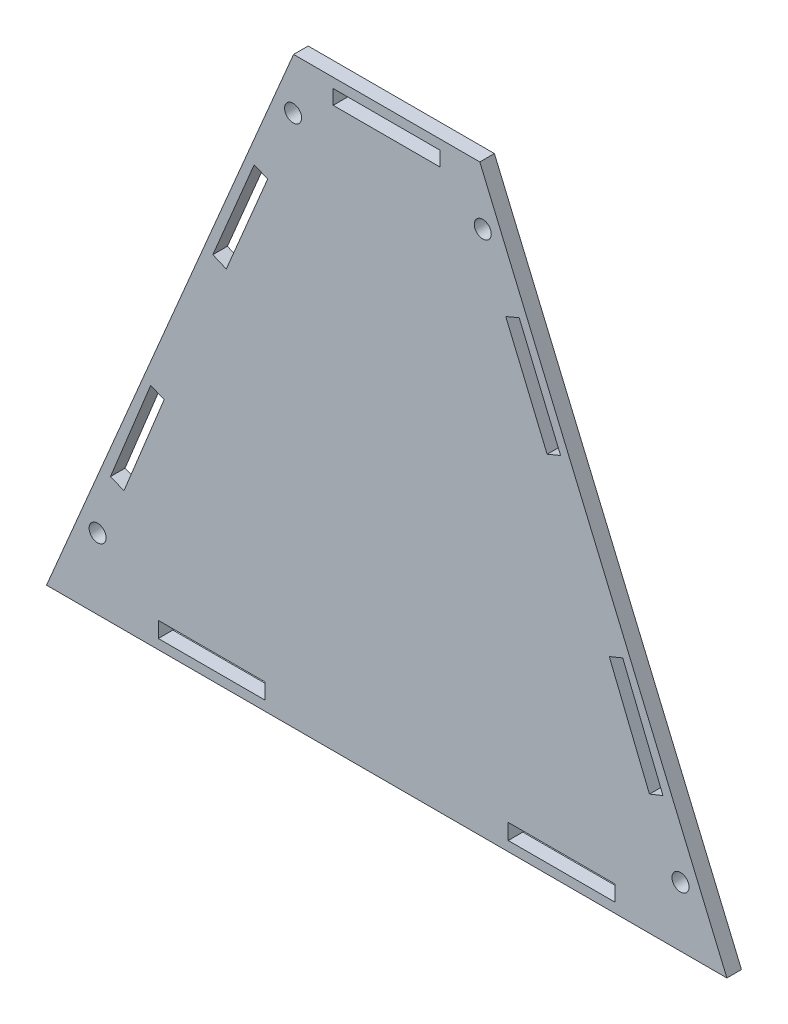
ISO-10303-21;
HEADER;
FILE_DESCRIPTION(('STEP AP214'),'2;1');
FILE_NAME('part.step','',(''),(''),'','','');
FILE_SCHEMA(('AUTOMOTIVE_DESIGN { 1 0 10303 214 1 1 1 1 }'));
ENDSEC;
DATA;
#1=APPLICATION_CONTEXT('core data for automotive mechanical design processes');
#2=APPLICATION_PROTOCOL_DEFINITION('international standard','automotive_design',2000,#1);
#3=PRODUCT_CONTEXT('',#1,'mechanical');
#4=PRODUCT('Part','Part','',(#3));
#5=PRODUCT_RELATED_PRODUCT_CATEGORY('part','',(#4));
#6=PRODUCT_DEFINITION_FORMATION('','',#4);
#7=PRODUCT_DEFINITION_CONTEXT('part definition',#1,'design');
#8=PRODUCT_DEFINITION('design','',#6,#7);
#9=PRODUCT_DEFINITION_SHAPE('','',#8);
#10=(LENGTH_UNIT() NAMED_UNIT(*) SI_UNIT(.MILLI.,.METRE.));
#11=(NAMED_UNIT(*) PLANE_ANGLE_UNIT() SI_UNIT($,.RADIAN.));
#12=(NAMED_UNIT(*) SI_UNIT($,.STERADIAN.) SOLID_ANGLE_UNIT());
#13=UNCERTAINTY_MEASURE_WITH_UNIT(LENGTH_MEASURE(1.E-05),#10,'distance_accuracy_value','');
#14=(GEOMETRIC_REPRESENTATION_CONTEXT(3) GLOBAL_UNCERTAINTY_ASSIGNED_CONTEXT((#13)) GLOBAL_UNIT_ASSIGNED_CONTEXT((#10,
#11,#12)) REPRESENTATION_CONTEXT('',''));
#15=CARTESIAN_POINT('',(0.,0.,0.));
#16=DIRECTION('',(0.,0.,1.));
#17=DIRECTION('',(1.,0.,0.));
#18=AXIS2_PLACEMENT_3D('',#15,#16,#17);
#19=CARTESIAN_POINT('',(0.,0.,3.));
#20=DIRECTION('',(0.,0.,1.));
#21=DIRECTION('',(1.,0.,0.));
#22=AXIS2_PLACEMENT_3D('',#19,#20,#21);
#23=PLANE('',#22);
#24=DIRECTION('',(0.,1.,0.));
#25=VECTOR('',#24,1.);
#26=CARTESIAN_POINT('',(80.9813954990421,0.,3.));
#27=LINE('',#26,#25);
#28=CARTESIAN_POINT('',(80.9813954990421,48.5,3.));
#29=VERTEX_POINT('',#28);
#30=CARTESIAN_POINT('',(80.9813954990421,51.5,3.));
#31=VERTEX_POINT('',#30);
#32=EDGE_CURVE('E418',#29,#31,#27,.T.);
#33=ORIENTED_EDGE('',*,*,#32,.F.);
#34=DIRECTION('',(1.,0.,0.));
#35=VECTOR('',#34,1.);
#36=CARTESIAN_POINT('',(0.,48.5,3.));
#37=LINE('',#36,#35);
#38=CARTESIAN_POINT('',(58.9813954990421,48.5,3.));
#39=VERTEX_POINT('',#38);
#40=EDGE_CURVE('E410',#39,#29,#37,.T.);
#41=ORIENTED_EDGE('',*,*,#40,.F.);
#42=DIRECTION('',(0.,1.,0.));
#43=VECTOR('',#42,1.);
#44=CARTESIAN_POINT('',(58.9813954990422,1.36421881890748E-13,3.));
#45=LINE('',#44,#43);
#46=CARTESIAN_POINT('',(58.9813954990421,51.5,3.));
#47=VERTEX_POINT('',#46);
#48=EDGE_CURVE('E412',#39,#47,#45,.T.);
#49=ORIENTED_EDGE('',*,*,#48,.T.);
#50=DIRECTION('',(1.,0.,0.));
#51=VECTOR('',#50,1.);
#52=CARTESIAN_POINT('',(0.,51.5,3.));
#53=LINE('',#52,#51);
#54=EDGE_CURVE('E415',#47,#31,#53,.T.);
#55=ORIENTED_EDGE('',*,*,#54,.T.);
#56=EDGE_LOOP('',(#33,#41,#49,#55));
#57=FACE_BOUND('',#56,.T.);
#58=DIRECTION('',(-0.9220208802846,0.387140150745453,0.));
#59=VECTOR('',#58,1.);
#60=CARTESIAN_POINT('',(17.0379976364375,40.5780427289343,3.));
#61=LINE('',#60,#59);
#62=CARTESIAN_POINT('',(45.5052483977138,28.6251510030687,3.));
#63=VERTEX_POINT('',#62);
#64=CARTESIAN_POINT('',(42.73918575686,29.7865714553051,3.));
#65=VERTEX_POINT('',#64);
#66=EDGE_CURVE('E408',#63,#65,#61,.T.);
#67=ORIENTED_EDGE('',*,*,#66,.F.);
#68=DIRECTION('',(0.387140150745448,0.922020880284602,0.));
#69=VECTOR('',#68,1.);
#70=CARTESIAN_POINT('',(28.4672507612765,-11.9528917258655,3.));
#71=LINE('',#70,#69);
#72=CARTESIAN_POINT('',(36.9881650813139,8.34069163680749,3.));
#73=VERTEX_POINT('',#72);
#74=EDGE_CURVE('E400',#73,#63,#71,.T.);
#75=ORIENTED_EDGE('',*,*,#74,.F.);
#76=DIRECTION('',(-0.922020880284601,0.387140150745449,0.));
#77=VECTOR('',#76,1.);
#78=CARTESIAN_POINT('',(8.52091432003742,20.293583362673,3.));
#79=LINE('',#78,#77);
#80=CARTESIAN_POINT('',(34.2221024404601,9.50211208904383,3.));
#81=VERTEX_POINT('',#80);
#82=EDGE_CURVE('E402',#73,#81,#79,.T.);
#83=ORIENTED_EDGE('',*,*,#82,.T.);
#84=DIRECTION('',(0.387140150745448,0.922020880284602,0.));
#85=VECTOR('',#84,1.);
#86=CARTESIAN_POINT('',(25.7011881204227,-10.7914712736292,3.));
#87=LINE('',#86,#85);
#88=EDGE_CURVE('E405',#81,#65,#87,.T.);
#89=ORIENTED_EDGE('',*,*,#88,.T.);
#90=EDGE_LOOP('',(#67,#75,#83,#89));
#91=FACE_BOUND('',#90,.T.);
#92=DIRECTION('',(-0.926585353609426,0.376084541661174,0.));
#93=VECTOR('',#92,1.);
#94=CARTESIAN_POINT('',(-4.00304452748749,-9.86257614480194,3.));
#95=LINE('',#94,#93);
#96=CARTESIAN_POINT('',(24.2108349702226,-21.3140888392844,3.));
#97=VERTEX_POINT('',#96);
#98=CARTESIAN_POINT('',(21.4310789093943,-20.1858352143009,3.));
#99=VERTEX_POINT('',#98);
#100=EDGE_CURVE('E398',#97,#99,#95,.T.);
#101=ORIENTED_EDGE('',*,*,#100,.F.);
#102=DIRECTION('',(0.376084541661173,0.926585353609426,0.));
#103=VECTOR('',#102,1.);
#104=CARTESIAN_POINT('',(28.21387949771,-11.4515126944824,3.));
#105=LINE('',#104,#103);
#106=CARTESIAN_POINT('',(15.9369750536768,-41.6989666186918,3.));
#107=VERTEX_POINT('',#106);
#108=EDGE_CURVE('E390',#107,#97,#105,.T.);
#109=ORIENTED_EDGE('',*,*,#108,.F.);
#110=DIRECTION('',(-0.926585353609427,0.376084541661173,0.));
#111=VECTOR('',#110,1.);
#112=CARTESIAN_POINT('',(-12.2769044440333,-30.2474539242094,3.));
#113=LINE('',#112,#111);
#114=CARTESIAN_POINT('',(13.1572189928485,-40.5707129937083,3.));
#115=VERTEX_POINT('',#114);
#116=EDGE_CURVE('E392',#107,#115,#113,.T.);
#117=ORIENTED_EDGE('',*,*,#116,.T.);
#118=DIRECTION('',(0.376084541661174,0.926585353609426,0.));
#119=VECTOR('',#118,1.);
#120=CARTESIAN_POINT('',(25.4341234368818,-10.3232590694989,3.));
#121=LINE('',#120,#119);
#122=EDGE_CURVE('E395',#115,#99,#121,.T.);
#123=ORIENTED_EDGE('',*,*,#122,.T.);
#124=EDGE_LOOP('',(#101,#109,#117,#123));
#125=FACE_BOUND('',#124,.T.);
#126=DIRECTION('',(0.,1.,0.));
#127=VECTOR('',#126,1.);
#128=CARTESIAN_POINT('',(117.,0.,3.));
#129=LINE('',#128,#127);
#130=CARTESIAN_POINT('',(117.,-64.5,3.));
#131=VERTEX_POINT('',#130);
#132=CARTESIAN_POINT('',(117.,-61.2694029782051,3.));
#133=VERTEX_POINT('',#132);
#134=EDGE_CURVE('E377',#131,#133,#129,.T.);
#135=ORIENTED_EDGE('',*,*,#134,.F.);
#136=DIRECTION('',(1.,0.,0.));
#137=VECTOR('',#136,1.);
#138=CARTESIAN_POINT('',(0.,-64.4999999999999,3.));
#139=LINE('',#138,#137);
#140=CARTESIAN_POINT('',(95.,-64.5,3.));
#141=VERTEX_POINT('',#140);
#142=EDGE_CURVE('E269',#141,#131,#139,.T.);
#143=ORIENTED_EDGE('',*,*,#142,.F.);
#144=DIRECTION('',(0.,1.,0.));
#145=VECTOR('',#144,1.);
#146=CARTESIAN_POINT('',(95.,0.,3.));
#147=LINE('',#146,#145);
#148=CARTESIAN_POINT('',(95.,-61.2694029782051,3.));
#149=VERTEX_POINT('',#148);
#150=EDGE_CURVE('E371',#141,#149,#147,.T.);
#151=ORIENTED_EDGE('',*,*,#150,.T.);
#152=DIRECTION('',(1.,0.,0.));
#153=VECTOR('',#152,1.);
#154=CARTESIAN_POINT('',(0.,-61.2694029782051,3.));
#155=LINE('',#154,#153);
#156=EDGE_CURVE('E374',#149,#133,#155,.T.);
#157=ORIENTED_EDGE('',*,*,#156,.T.);
#158=EDGE_LOOP('',(#135,#143,#151,#157));
#159=FACE_BOUND('',#158,.T.);
#160=DIRECTION('',(-1.,0.,0.));
#161=VECTOR('',#160,1.);
#162=CARTESIAN_POINT('',(0.,-61.2694029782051,3.));
#163=LINE('',#162,#161);
#164=CARTESIAN_POINT('',(45.,-61.2694029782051,3.));
#165=VERTEX_POINT('',#164);
#166=CARTESIAN_POINT('',(23.,-61.2694029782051,3.));
#167=VERTEX_POINT('',#166);
#168=EDGE_CURVE('E457',#165,#167,#163,.T.);
#169=ORIENTED_EDGE('',*,*,#168,.F.);
#170=DIRECTION('',(0.,1.,0.));
#171=VECTOR('',#170,1.);
#172=CARTESIAN_POINT('',(45.,0.,3.));
#173=LINE('',#172,#171);
#174=CARTESIAN_POINT('',(45.,-64.5,3.));
#175=VERTEX_POINT('',#174);
#176=EDGE_CURVE('E443',#175,#165,#173,.T.);
#177=ORIENTED_EDGE('',*,*,#176,.F.);
#178=DIRECTION('',(-1.,0.,0.));
#179=VECTOR('',#178,1.);
#180=CARTESIAN_POINT('',(0.,-64.5,3.));
#181=LINE('',#180,#179);
#182=CARTESIAN_POINT('',(23.,-64.5,3.));
#183=VERTEX_POINT('',#182);
#184=EDGE_CURVE('E451',#175,#183,#181,.T.);
#185=ORIENTED_EDGE('',*,*,#184,.T.);
#186=DIRECTION('',(0.,1.,0.));
#187=VECTOR('',#186,1.);
#188=CARTESIAN_POINT('',(23.,0.,3.));
#189=LINE('',#188,#187);
#190=EDGE_CURVE('E454',#183,#167,#189,.T.);
#191=ORIENTED_EDGE('',*,*,#190,.T.);
#192=EDGE_LOOP('',(#169,#177,#185,#191));
#193=FACE_BOUND('',#192,.T.);
#194=CARTESIAN_POINT('',(89.7640486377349,41.8228509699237,3.));
#195=DIRECTION('',(0.,0.,1.));
#196=DIRECTION('',(1.,0.,0.));
#197=AXIS2_PLACEMENT_3D('',#194,#195,#196);
#198=CIRCLE('',#197,1.75);
#199=CARTESIAN_POINT('',(91.5140486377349,41.8228509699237,3.));
#200=VERTEX_POINT('',#199);
#201=EDGE_CURVE('E474',#200,#200,#198,.T.);
#202=ORIENTED_EDGE('',*,*,#201,.F.);
#203=EDGE_LOOP('',(#202));
#204=FACE_BOUND('',#203,.T.);
#205=CARTESIAN_POINT('',(50.7360447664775,43.0032701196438,3.));
#206=DIRECTION('',(0.,0.,1.));
#207=DIRECTION('',(1.,0.,0.));
#208=AXIS2_PLACEMENT_3D('',#205,#206,#207);
#209=CIRCLE('',#208,1.75);
#210=CARTESIAN_POINT('',(52.4860447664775,43.0032701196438,3.));
#211=VERTEX_POINT('',#210);
#212=EDGE_CURVE('E471',#211,#211,#209,.T.);
#213=ORIENTED_EDGE('',*,*,#212,.F.);
#214=EDGE_LOOP('',(#213));
#215=FACE_BOUND('',#214,.T.);
#216=CARTESIAN_POINT('',(10.5103858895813,-51.9452687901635,3.));
#217=DIRECTION('',(0.,0.,1.));
#218=DIRECTION('',(1.,0.,0.));
#219=AXIS2_PLACEMENT_3D('',#216,#217,#218);
#220=CIRCLE('',#219,1.75);
#221=CARTESIAN_POINT('',(12.2603858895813,-51.9452687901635,3.));
#222=VERTEX_POINT('',#221);
#223=EDGE_CURVE('E463',#222,#222,#220,.T.);
#224=ORIENTED_EDGE('',*,*,#223,.F.);
#225=EDGE_LOOP('',(#224));
#226=FACE_BOUND('',#225,.T.);
#227=CARTESIAN_POINT('',(130.451332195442,-54.2153056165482,3.));
#228=DIRECTION('',(0.,0.,1.));
#229=DIRECTION('',(1.,0.,0.));
#230=AXIS2_PLACEMENT_3D('',#227,#228,#229);
#231=CIRCLE('',#230,1.75000000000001);
#232=CARTESIAN_POINT('',(132.201332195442,-54.2153056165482,3.));
#233=VERTEX_POINT('',#232);
#234=EDGE_CURVE('E480',#233,#233,#231,.T.);
#235=ORIENTED_EDGE('',*,*,#234,.F.);
#236=EDGE_LOOP('',(#235));
#237=FACE_BOUND('',#236,.T.);
#238=DIRECTION('',(-0.390093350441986,0.920775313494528,0.));
#239=VECTOR('',#238,1.);
#240=CARTESIAN_POINT('',(89.1611022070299,53.5,3.));
#241=LINE('',#240,#239);
#242=CARTESIAN_POINT('',(140.,-66.5,3.));
#243=VERTEX_POINT('',#242);
#244=CARTESIAN_POINT('',(89.1611022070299,53.5,3.));
#245=VERTEX_POINT('',#244);
#246=EDGE_CURVE('E484',#243,#245,#241,.T.);
#247=ORIENTED_EDGE('',*,*,#246,.T.);
#248=DIRECTION('',(-1.,0.,0.));
#249=VECTOR('',#248,1.);
#250=CARTESIAN_POINT('',(50.8388977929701,53.5,3.));
#251=LINE('',#250,#249);
#252=CARTESIAN_POINT('',(50.8388977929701,53.5,3.));
#253=VERTEX_POINT('',#252);
#254=EDGE_CURVE('E487',#245,#253,#251,.T.);
#255=ORIENTED_EDGE('',*,*,#254,.T.);
#256=DIRECTION('',(-0.390093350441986,-0.920775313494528,0.));
#257=VECTOR('',#256,1.);
#258=CARTESIAN_POINT('',(50.8388977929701,53.5,3.));
#259=LINE('',#258,#257);
#260=CARTESIAN_POINT('',(0.,-66.5,3.));
#261=VERTEX_POINT('',#260);
#262=EDGE_CURVE('E490',#253,#261,#259,.T.);
#263=ORIENTED_EDGE('',*,*,#262,.T.);
#264=DIRECTION('',(1.,0.,0.));
#265=VECTOR('',#264,1.);
#266=CARTESIAN_POINT('',(0.,-66.5,3.));
#267=LINE('',#266,#265);
#268=EDGE_CURVE('E492',#261,#243,#267,.T.);
#269=ORIENTED_EDGE('',*,*,#268,.T.);
#270=EDGE_LOOP('',(#247,#255,#263,#269));
#271=FACE_BOUND('',#270,.T.);
#272=DIRECTION('',(0.926585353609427,0.376084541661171,0.));
#273=VECTOR('',#272,1.);
#274=CARTESIAN_POINT('',(32.0784459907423,-79.0338738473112,3.));
#275=LINE('',#274,#273);
#276=CARTESIAN_POINT('',(124.063024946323,-41.6989666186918,3.));
#277=VERTEX_POINT('',#276);
#278=CARTESIAN_POINT('',(126.842781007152,-40.5707129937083,3.));
#279=VERTEX_POINT('',#278);
#280=EDGE_CURVE('E385',#277,#279,#275,.T.);
#281=ORIENTED_EDGE('',*,*,#280,.F.);
#282=DIRECTION('',(-0.376084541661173,0.926585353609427,0.));
#283=VECTOR('',#282,1.);
#284=CARTESIAN_POINT('',(91.9845789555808,37.3349072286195,3.));
#285=LINE('',#284,#283);
#286=CARTESIAN_POINT('',(115.789165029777,-21.3140888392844,3.));
#287=VERTEX_POINT('',#286);
#288=EDGE_CURVE('E387',#277,#287,#285,.T.);
#289=ORIENTED_EDGE('',*,*,#288,.T.);
#290=DIRECTION('',(0.926585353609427,0.376084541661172,0.));
#291=VECTOR('',#290,1.);
#292=CARTESIAN_POINT('',(23.8045860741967,-58.6489960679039,3.));
#293=LINE('',#292,#291);
#294=CARTESIAN_POINT('',(118.568921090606,-20.1858352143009,3.));
#295=VERTEX_POINT('',#294);
#296=EDGE_CURVE('E379',#287,#295,#293,.T.);
#297=ORIENTED_EDGE('',*,*,#296,.T.);
#298=DIRECTION('',(-0.376084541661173,0.926585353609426,0.));
#299=VECTOR('',#298,1.);
#300=CARTESIAN_POINT('',(94.764335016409,38.463160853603,3.));
#301=LINE('',#300,#299);
#302=EDGE_CURVE('E382',#279,#295,#301,.T.);
#303=ORIENTED_EDGE('',*,*,#302,.F.);
#304=EDGE_LOOP('',(#281,#289,#297,#303));
#305=FACE_BOUND('',#304,.T.);
#306=DIRECTION('',(-0.387140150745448,0.922020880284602,0.));
#307=VECTOR('',#306,1.);
#308=CARTESIAN_POINT('',(90.5498997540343,38.0202906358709,3.));
#309=LINE('',#308,#307);
#310=CARTESIAN_POINT('',(103.011834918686,8.34069163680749,3.));
#311=VERTEX_POINT('',#310);
#312=CARTESIAN_POINT('',(94.4947516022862,28.6251510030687,3.));
#313=VERTEX_POINT('',#312);
#314=EDGE_CURVE('E423',#311,#313,#309,.T.);
#315=ORIENTED_EDGE('',*,*,#314,.T.);
#316=DIRECTION('',(0.922020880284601,0.38714015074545,0.));
#317=VECTOR('',#316,1.);
#318=CARTESIAN_POINT('',(3.94485184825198,-9.39513963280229,3.));
#319=LINE('',#318,#317);
#320=CARTESIAN_POINT('',(97.26081424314,29.7865714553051,3.));
#321=VERTEX_POINT('',#320);
#322=EDGE_CURVE('E426',#313,#321,#319,.T.);
#323=ORIENTED_EDGE('',*,*,#322,.T.);
#324=DIRECTION('',(-0.387140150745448,0.922020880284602,0.));
#325=VECTOR('',#324,1.);
#326=CARTESIAN_POINT('',(93.3159623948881,39.1817110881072,3.));
#327=LINE('',#326,#325);
#328=CARTESIAN_POINT('',(105.77789755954,9.50211208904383,3.));
#329=VERTEX_POINT('',#328);
#330=EDGE_CURVE('E420',#329,#321,#327,.T.);
#331=ORIENTED_EDGE('',*,*,#330,.F.);
#332=DIRECTION('',(0.922020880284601,0.387140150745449,0.));
#333=VECTOR('',#332,1.);
#334=CARTESIAN_POINT('',(12.4619351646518,-29.6795989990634,3.));
#335=LINE('',#334,#333);
#336=EDGE_CURVE('E247',#311,#329,#335,.T.);
#337=ORIENTED_EDGE('',*,*,#336,.F.);
#338=EDGE_LOOP('',(#315,#323,#331,#337));
#339=FACE_BOUND('',#338,.T.);
#340=ADVANCED_FACE('F33',(#57,#91,#125,#159,#193,#204,#215,#226,#237,#271,#305,#339),#23,.T.);
#341=CARTESIAN_POINT('',(0.,0.,0.));
#342=DIRECTION('',(0.,0.,1.));
#343=DIRECTION('',(1.,0.,0.));
#344=AXIS2_PLACEMENT_3D('',#341,#342,#343);
#345=PLANE('',#344);
#346=DIRECTION('',(0.376084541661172,-0.926585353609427,0.));
#347=VECTOR('',#346,1.);
#348=CARTESIAN_POINT('',(115.789165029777,-21.3140888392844,0.));
#349=LINE('',#348,#347);
#350=CARTESIAN_POINT('',(115.789165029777,-21.3140888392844,0.));
#351=VERTEX_POINT('',#350);
#352=CARTESIAN_POINT('',(124.063024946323,-41.6989666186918,0.));
#353=VERTEX_POINT('',#352);
#354=EDGE_CURVE('E320',#351,#353,#349,.T.);
#355=ORIENTED_EDGE('',*,*,#354,.T.);
#356=DIRECTION('',(-0.926585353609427,-0.376084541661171,0.));
#357=VECTOR('',#356,1.);
#358=CARTESIAN_POINT('',(126.842781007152,-40.5707129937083,0.));
#359=LINE('',#358,#357);
#360=CARTESIAN_POINT('',(126.842781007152,-40.5707129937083,0.));
#361=VERTEX_POINT('',#360);
#362=EDGE_CURVE('E346',#361,#353,#359,.T.);
#363=ORIENTED_EDGE('',*,*,#362,.F.);
#364=DIRECTION('',(0.376084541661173,-0.926585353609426,0.));
#365=VECTOR('',#364,1.);
#366=CARTESIAN_POINT('',(118.568921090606,-20.1858352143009,0.));
#367=LINE('',#366,#365);
#368=CARTESIAN_POINT('',(118.568921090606,-20.1858352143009,0.));
#369=VERTEX_POINT('',#368);
#370=EDGE_CURVE('E343',#369,#361,#367,.T.);
#371=ORIENTED_EDGE('',*,*,#370,.F.);
#372=DIRECTION('',(-0.926585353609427,-0.376084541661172,0.));
#373=VECTOR('',#372,1.);
#374=CARTESIAN_POINT('',(118.568921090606,-20.1858352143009,0.));
#375=LINE('',#374,#373);
#376=EDGE_CURVE('E340',#369,#351,#375,.T.);
#377=ORIENTED_EDGE('',*,*,#376,.T.);
#378=EDGE_LOOP('',(#355,#363,#371,#377));
#379=FACE_BOUND('',#378,.T.);
#380=DIRECTION('',(-1.,0.,0.));
#381=VECTOR('',#380,1.);
#382=CARTESIAN_POINT('',(117.,-64.5,0.));
#383=LINE('',#382,#381);
#384=CARTESIAN_POINT('',(117.,-64.5,0.));
#385=VERTEX_POINT('',#384);
#386=CARTESIAN_POINT('',(95.,-64.5,0.));
#387=VERTEX_POINT('',#386);
#388=EDGE_CURVE('E366',#385,#387,#383,.T.);
#389=ORIENTED_EDGE('',*,*,#388,.F.);
#390=DIRECTION('',(0.,-1.,0.));
#391=VECTOR('',#390,1.);
#392=CARTESIAN_POINT('',(117.,-61.2694029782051,0.));
#393=LINE('',#392,#391);
#394=CARTESIAN_POINT('',(117.,-61.2694029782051,0.));
#395=VERTEX_POINT('',#394);
#396=EDGE_CURVE('E333',#395,#385,#393,.T.);
#397=ORIENTED_EDGE('',*,*,#396,.F.);
#398=DIRECTION('',(-1.,0.,0.));
#399=VECTOR('',#398,1.);
#400=CARTESIAN_POINT('',(117.,-61.2694029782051,0.));
#401=LINE('',#400,#399);
#402=CARTESIAN_POINT('',(95.,-61.2694029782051,0.));
#403=VERTEX_POINT('',#402);
#404=EDGE_CURVE('E354',#395,#403,#401,.T.);
#405=ORIENTED_EDGE('',*,*,#404,.T.);
#406=DIRECTION('',(0.,-1.,0.));
#407=VECTOR('',#406,1.);
#408=CARTESIAN_POINT('',(95.,-61.2694029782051,0.));
#409=LINE('',#408,#407);
#410=EDGE_CURVE('E363',#403,#387,#409,.T.);
#411=ORIENTED_EDGE('',*,*,#410,.T.);
#412=EDGE_LOOP('',(#389,#397,#405,#411));
#413=FACE_BOUND('',#412,.T.);
#414=DIRECTION('',(0.,-1.,0.));
#415=VECTOR('',#414,1.);
#416=CARTESIAN_POINT('',(45.,0.,0.));
#417=LINE('',#416,#415);
#418=CARTESIAN_POINT('',(45.,-61.2694029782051,0.));
#419=VERTEX_POINT('',#418);
#420=CARTESIAN_POINT('',(45.,-64.5,0.));
#421=VERTEX_POINT('',#420);
#422=EDGE_CURVE('E431',#419,#421,#417,.T.);
#423=ORIENTED_EDGE('',*,*,#422,.F.);
#424=DIRECTION('',(1.,0.,0.));
#425=VECTOR('',#424,1.);
#426=CARTESIAN_POINT('',(0.,-61.2694029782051,0.));
#427=LINE('',#426,#425);
#428=CARTESIAN_POINT('',(23.,-61.2694029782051,0.));
#429=VERTEX_POINT('',#428);
#430=EDGE_CURVE('E429',#429,#419,#427,.T.);
#431=ORIENTED_EDGE('',*,*,#430,.F.);
#432=DIRECTION('',(0.,-1.,0.));
#433=VECTOR('',#432,1.);
#434=CARTESIAN_POINT('',(23.,0.,0.));
#435=LINE('',#434,#433);
#436=CARTESIAN_POINT('',(23.,-64.5,0.));
#437=VERTEX_POINT('',#436);
#438=EDGE_CURVE('E437',#429,#437,#435,.T.);
#439=ORIENTED_EDGE('',*,*,#438,.T.);
#440=DIRECTION('',(1.,0.,0.));
#441=VECTOR('',#440,1.);
#442=CARTESIAN_POINT('',(0.,-64.5,0.));
#443=LINE('',#442,#441);
#444=EDGE_CURVE('E434',#437,#421,#443,.T.);
#445=ORIENTED_EDGE('',*,*,#444,.T.);
#446=EDGE_LOOP('',(#423,#431,#439,#445));
#447=FACE_BOUND('',#446,.T.);
#448=CARTESIAN_POINT('',(89.7640486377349,41.8228509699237,0.));
#449=DIRECTION('',(0.,0.,-1.));
#450=DIRECTION('',(-1.,0.,0.));
#451=AXIS2_PLACEMENT_3D('',#448,#449,#450);
#452=CIRCLE('',#451,1.75);
#453=CARTESIAN_POINT('',(88.0140486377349,41.8228509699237,0.));
#454=VERTEX_POINT('',#453);
#455=EDGE_CURVE('E460',#454,#454,#452,.T.);
#456=ORIENTED_EDGE('',*,*,#455,.F.);
#457=EDGE_LOOP('',(#456));
#458=FACE_BOUND('',#457,.T.);
#459=CARTESIAN_POINT('',(50.7360447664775,43.0032701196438,0.));
#460=DIRECTION('',(0.,0.,-1.));
#461=DIRECTION('',(-1.,0.,0.));
#462=AXIS2_PLACEMENT_3D('',#459,#460,#461);
#463=CIRCLE('',#462,1.75);
#464=CARTESIAN_POINT('',(48.9860447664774,43.0032701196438,0.));
#465=VERTEX_POINT('',#464);
#466=EDGE_CURVE('E464',#465,#465,#463,.T.);
#467=ORIENTED_EDGE('',*,*,#466,.F.);
#468=EDGE_LOOP('',(#467));
#469=FACE_BOUND('',#468,.T.);
#470=CARTESIAN_POINT('',(10.5103858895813,-51.9452687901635,0.));
#471=DIRECTION('',(0.,0.,-1.));
#472=DIRECTION('',(-1.,0.,0.));
#473=AXIS2_PLACEMENT_3D('',#470,#471,#472);
#474=CIRCLE('',#473,1.75);
#475=CARTESIAN_POINT('',(8.7603858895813,-51.9452687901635,0.));
#476=VERTEX_POINT('',#475);
#477=EDGE_CURVE('E459',#476,#476,#474,.T.);
#478=ORIENTED_EDGE('',*,*,#477,.F.);
#479=EDGE_LOOP('',(#478));
#480=FACE_BOUND('',#479,.T.);
#481=CARTESIAN_POINT('',(130.451332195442,-54.2153056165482,0.));
#482=DIRECTION('',(0.,0.,-1.));
#483=DIRECTION('',(-1.,0.,0.));
#484=AXIS2_PLACEMENT_3D('',#481,#482,#483);
#485=CIRCLE('',#484,1.75000000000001);
#486=CARTESIAN_POINT('',(128.701332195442,-54.2153056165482,0.));
#487=VERTEX_POINT('',#486);
#488=EDGE_CURVE('E477',#487,#487,#485,.T.);
#489=ORIENTED_EDGE('',*,*,#488,.F.);
#490=EDGE_LOOP('',(#489));
#491=FACE_BOUND('',#490,.T.);
#492=DIRECTION('',(-0.390093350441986,0.920775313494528,0.));
#493=VECTOR('',#492,1.);
#494=CARTESIAN_POINT('',(89.1611022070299,53.5,0.));
#495=LINE('',#494,#493);
#496=CARTESIAN_POINT('',(140.,-66.5,0.));
#497=VERTEX_POINT('',#496);
#498=CARTESIAN_POINT('',(89.1611022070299,53.5,0.));
#499=VERTEX_POINT('',#498);
#500=EDGE_CURVE('E483',#497,#499,#495,.T.);
#501=ORIENTED_EDGE('',*,*,#500,.F.);
#502=DIRECTION('',(1.,0.,0.));
#503=VECTOR('',#502,1.);
#504=CARTESIAN_POINT('',(0.,-66.5,0.));
#505=LINE('',#504,#503);
#506=CARTESIAN_POINT('',(0.,-66.5,0.));
#507=VERTEX_POINT('',#506);
#508=EDGE_CURVE('E488',#507,#497,#505,.T.);
#509=ORIENTED_EDGE('',*,*,#508,.F.);
#510=DIRECTION('',(-0.390093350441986,-0.920775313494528,0.));
#511=VECTOR('',#510,1.);
#512=CARTESIAN_POINT('',(50.8388977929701,53.5,0.));
#513=LINE('',#512,#511);
#514=CARTESIAN_POINT('',(50.8388977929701,53.5,0.));
#515=VERTEX_POINT('',#514);
#516=EDGE_CURVE('E499',#515,#507,#513,.T.);
#517=ORIENTED_EDGE('',*,*,#516,.F.);
#518=DIRECTION('',(-1.,0.,0.));
#519=VECTOR('',#518,1.);
#520=CARTESIAN_POINT('',(50.8388977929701,53.5,0.));
#521=LINE('',#520,#519);
#522=EDGE_CURVE('E497',#499,#515,#521,.T.);
#523=ORIENTED_EDGE('',*,*,#522,.F.);
#524=EDGE_LOOP('',(#501,#509,#517,#523));
#525=FACE_BOUND('',#524,.T.);
#526=DIRECTION('',(-0.376084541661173,-0.926585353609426,0.));
#527=VECTOR('',#526,1.);
#528=CARTESIAN_POINT('',(24.2108349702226,-21.3140888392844,0.));
#529=LINE('',#528,#527);
#530=CARTESIAN_POINT('',(24.2108349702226,-21.3140888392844,0.));
#531=VERTEX_POINT('',#530);
#532=CARTESIAN_POINT('',(15.9369750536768,-41.6989666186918,0.));
#533=VERTEX_POINT('',#532);
#534=EDGE_CURVE('E326',#531,#533,#529,.T.);
#535=ORIENTED_EDGE('',*,*,#534,.F.);
#536=DIRECTION('',(0.926585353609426,-0.376084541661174,0.));
#537=VECTOR('',#536,1.);
#538=CARTESIAN_POINT('',(21.4310789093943,-20.1858352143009,0.));
#539=LINE('',#538,#537);
#540=CARTESIAN_POINT('',(21.4310789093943,-20.1858352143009,0.));
#541=VERTEX_POINT('',#540);
#542=EDGE_CURVE('E300',#541,#531,#539,.T.);
#543=ORIENTED_EDGE('',*,*,#542,.F.);
#544=DIRECTION('',(-0.376084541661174,-0.926585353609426,0.));
#545=VECTOR('',#544,1.);
#546=CARTESIAN_POINT('',(21.4310789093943,-20.1858352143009,0.));
#547=LINE('',#546,#545);
#548=CARTESIAN_POINT('',(13.1572189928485,-40.5707129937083,0.));
#549=VERTEX_POINT('',#548);
#550=EDGE_CURVE('E313',#541,#549,#547,.T.);
#551=ORIENTED_EDGE('',*,*,#550,.T.);
#552=DIRECTION('',(0.926585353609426,-0.376084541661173,0.));
#553=VECTOR('',#552,1.);
#554=CARTESIAN_POINT('',(13.1572189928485,-40.5707129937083,0.));
#555=LINE('',#554,#553);
#556=EDGE_CURVE('E323',#549,#533,#555,.T.);
#557=ORIENTED_EDGE('',*,*,#556,.T.);
#558=EDGE_LOOP('',(#535,#543,#551,#557));
#559=FACE_BOUND('',#558,.T.);
#560=DIRECTION('',(-0.387140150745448,-0.922020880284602,0.));
#561=VECTOR('',#560,1.);
#562=CARTESIAN_POINT('',(45.5052483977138,28.6251510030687,0.));
#563=LINE('',#562,#561);
#564=CARTESIAN_POINT('',(45.5052483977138,28.6251510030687,0.));
#565=VERTEX_POINT('',#564);
#566=CARTESIAN_POINT('',(36.9881650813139,8.34069163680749,0.));
#567=VERTEX_POINT('',#566);
#568=EDGE_CURVE('E306',#565,#567,#563,.T.);
#569=ORIENTED_EDGE('',*,*,#568,.F.);
#570=DIRECTION('',(0.9220208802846,-0.387140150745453,0.));
#571=VECTOR('',#570,1.);
#572=CARTESIAN_POINT('',(42.73918575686,29.7865714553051,0.));
#573=LINE('',#572,#571);
#574=CARTESIAN_POINT('',(42.73918575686,29.7865714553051,0.));
#575=VERTEX_POINT('',#574);
#576=EDGE_CURVE('E279',#575,#565,#573,.T.);
#577=ORIENTED_EDGE('',*,*,#576,.F.);
#578=DIRECTION('',(-0.387140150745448,-0.922020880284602,0.));
#579=VECTOR('',#578,1.);
#580=CARTESIAN_POINT('',(42.73918575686,29.7865714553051,0.));
#581=LINE('',#580,#579);
#582=CARTESIAN_POINT('',(34.2221024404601,9.50211208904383,0.));
#583=VERTEX_POINT('',#582);
#584=EDGE_CURVE('E293',#575,#583,#581,.T.);
#585=ORIENTED_EDGE('',*,*,#584,.T.);
#586=DIRECTION('',(0.922020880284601,-0.387140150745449,0.));
#587=VECTOR('',#586,1.);
#588=CARTESIAN_POINT('',(34.2221024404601,9.50211208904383,0.));
#589=LINE('',#588,#587);
#590=EDGE_CURVE('E303',#583,#567,#589,.T.);
#591=ORIENTED_EDGE('',*,*,#590,.T.);
#592=EDGE_LOOP('',(#569,#577,#585,#591));
#593=FACE_BOUND('',#592,.T.);
#594=DIRECTION('',(-1.,0.,0.));
#595=VECTOR('',#594,1.);
#596=CARTESIAN_POINT('',(80.9813954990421,48.5,0.));
#597=LINE('',#596,#595);
#598=CARTESIAN_POINT('',(80.9813954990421,48.5,0.));
#599=VERTEX_POINT('',#598);
#600=CARTESIAN_POINT('',(58.9813954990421,48.5,0.));
#601=VERTEX_POINT('',#600);
#602=EDGE_CURVE('E285',#599,#601,#597,.T.);
#603=ORIENTED_EDGE('',*,*,#602,.F.);
#604=DIRECTION('',(0.,-1.,0.));
#605=VECTOR('',#604,1.);
#606=CARTESIAN_POINT('',(80.9813954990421,51.5,0.));
#607=LINE('',#606,#605);
#608=CARTESIAN_POINT('',(80.9813954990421,51.5,0.));
#609=VERTEX_POINT('',#608);
#610=EDGE_CURVE('E287',#609,#599,#607,.T.);
#611=ORIENTED_EDGE('',*,*,#610,.F.);
#612=DIRECTION('',(-1.,0.,0.));
#613=VECTOR('',#612,1.);
#614=CARTESIAN_POINT('',(80.9813954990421,51.5,0.));
#615=LINE('',#614,#613);
#616=CARTESIAN_POINT('',(58.9813954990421,51.5,0.));
#617=VERTEX_POINT('',#616);
#618=EDGE_CURVE('E273',#609,#617,#615,.T.);
#619=ORIENTED_EDGE('',*,*,#618,.T.);
#620=DIRECTION('',(0.,-1.,0.));
#621=VECTOR('',#620,1.);
#622=CARTESIAN_POINT('',(58.9813954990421,51.5,0.));
#623=LINE('',#622,#621);
#624=EDGE_CURVE('E282',#617,#601,#623,.T.);
#625=ORIENTED_EDGE('',*,*,#624,.T.);
#626=EDGE_LOOP('',(#603,#611,#619,#625));
#627=FACE_BOUND('',#626,.T.);
#628=DIRECTION('',(-0.922020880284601,-0.38714015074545,0.));
#629=VECTOR('',#628,1.);
#630=CARTESIAN_POINT('',(97.26081424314,29.7865714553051,0.));
#631=LINE('',#630,#629);
#632=CARTESIAN_POINT('',(97.26081424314,29.7865714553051,0.));
#633=VERTEX_POINT('',#632);
#634=CARTESIAN_POINT('',(94.4947516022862,28.6251510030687,0.));
#635=VERTEX_POINT('',#634);
#636=EDGE_CURVE('E264',#633,#635,#631,.T.);
#637=ORIENTED_EDGE('',*,*,#636,.T.);
#638=DIRECTION('',(0.387140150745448,-0.922020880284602,0.));
#639=VECTOR('',#638,1.);
#640=CARTESIAN_POINT('',(94.4947516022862,28.6251510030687,0.));
#641=LINE('',#640,#639);
#642=CARTESIAN_POINT('',(103.011834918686,8.34069163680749,0.));
#643=VERTEX_POINT('',#642);
#644=EDGE_CURVE('E262',#635,#643,#641,.T.);
#645=ORIENTED_EDGE('',*,*,#644,.T.);
#646=DIRECTION('',(-0.922020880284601,-0.387140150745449,0.));
#647=VECTOR('',#646,1.);
#648=CARTESIAN_POINT('',(105.77789755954,9.50211208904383,0.));
#649=LINE('',#648,#647);
#650=CARTESIAN_POINT('',(105.77789755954,9.50211208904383,0.));
#651=VERTEX_POINT('',#650);
#652=EDGE_CURVE('E244',#651,#643,#649,.T.);
#653=ORIENTED_EDGE('',*,*,#652,.F.);
#654=DIRECTION('',(0.387140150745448,-0.922020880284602,0.));
#655=VECTOR('',#654,1.);
#656=CARTESIAN_POINT('',(97.26081424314,29.7865714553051,0.));
#657=LINE('',#656,#655);
#658=EDGE_CURVE('E254',#633,#651,#657,.T.);
#659=ORIENTED_EDGE('',*,*,#658,.F.);
#660=EDGE_LOOP('',(#637,#645,#653,#659));
#661=FACE_BOUND('',#660,.T.);
#662=ADVANCED_FACE('F260',(#379,#413,#447,#458,#469,#480,#491,#525,#559,#593,#627,#661),#345,.F.);
#663=CARTESIAN_POINT('',(89.1611022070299,53.5,3.));
#664=DIRECTION('',(-0.920775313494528,-0.390093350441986,0.));
#665=DIRECTION('',(0.390093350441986,-0.920775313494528,0.));
#666=AXIS2_PLACEMENT_3D('',#663,#664,#665);
#667=PLANE('',#666);
#668=ORIENTED_EDGE('',*,*,#500,.T.);
#669=DIRECTION('',(0.,0.,-1.));
#670=VECTOR('',#669,1.);
#671=CARTESIAN_POINT('',(89.1611022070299,53.5,3.));
#672=LINE('',#671,#670);
#673=EDGE_CURVE('E11',#245,#499,#672,.T.);
#674=ORIENTED_EDGE('',*,*,#673,.F.);
#675=ORIENTED_EDGE('',*,*,#246,.F.);
#676=DIRECTION('',(0.,0.,-1.));
#677=VECTOR('',#676,1.);
#678=CARTESIAN_POINT('',(140.,-66.5,3.));
#679=LINE('',#678,#677);
#680=EDGE_CURVE('E494',#243,#497,#679,.T.);
#681=ORIENTED_EDGE('',*,*,#680,.T.);
#682=EDGE_LOOP('',(#668,#674,#675,#681));
#683=FACE_BOUND('',#682,.T.);
#684=ADVANCED_FACE('F35',(#683),#667,.F.);
#685=CARTESIAN_POINT('',(50.8388977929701,53.5,3.));
#686=DIRECTION('',(0.,-1.,0.));
#687=DIRECTION('',(1.,0.,0.));
#688=AXIS2_PLACEMENT_3D('',#685,#686,#687);
#689=PLANE('',#688);
#690=ORIENTED_EDGE('',*,*,#522,.T.);
#691=DIRECTION('',(0.,0.,-1.));
#692=VECTOR('',#691,1.);
#693=CARTESIAN_POINT('',(50.8388977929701,53.5,3.));
#694=LINE('',#693,#692);
#695=EDGE_CURVE('E41',#253,#515,#694,.T.);
#696=ORIENTED_EDGE('',*,*,#695,.F.);
#697=ORIENTED_EDGE('',*,*,#254,.F.);
#698=ORIENTED_EDGE('',*,*,#673,.T.);
#699=EDGE_LOOP('',(#690,#696,#697,#698));
#700=FACE_BOUND('',#699,.T.);
#701=ADVANCED_FACE('F527',(#700),#689,.F.);
#702=CARTESIAN_POINT('',(50.8388977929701,53.5,3.));
#703=DIRECTION('',(0.920775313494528,-0.390093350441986,0.));
#704=DIRECTION('',(0.390093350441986,0.920775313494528,0.));
#705=AXIS2_PLACEMENT_3D('',#702,#703,#704);
#706=PLANE('',#705);
#707=ORIENTED_EDGE('',*,*,#516,.T.);
#708=DIRECTION('',(0.,0.,-1.));
#709=VECTOR('',#708,1.);
#710=CARTESIAN_POINT('',(0.,-66.5,3.));
#711=LINE('',#710,#709);
#712=EDGE_CURVE('E504',#261,#507,#711,.T.);
#713=ORIENTED_EDGE('',*,*,#712,.F.);
#714=ORIENTED_EDGE('',*,*,#262,.F.);
#715=ORIENTED_EDGE('',*,*,#695,.T.);
#716=EDGE_LOOP('',(#707,#713,#714,#715));
#717=FACE_BOUND('',#716,.T.);
#718=ADVANCED_FACE('F511',(#717),#706,.F.);
#719=CARTESIAN_POINT('',(0.,-66.5,3.));
#720=DIRECTION('',(0.,1.,0.));
#721=DIRECTION('',(0.,0.,1.));
#722=AXIS2_PLACEMENT_3D('',#719,#720,#721);
#723=PLANE('',#722);
#724=ORIENTED_EDGE('',*,*,#508,.T.);
#725=ORIENTED_EDGE('',*,*,#680,.F.);
#726=ORIENTED_EDGE('',*,*,#268,.F.);
#727=ORIENTED_EDGE('',*,*,#712,.T.);
#728=EDGE_LOOP('',(#724,#725,#726,#727));
#729=FACE_BOUND('',#728,.T.);
#730=ADVANCED_FACE('F520',(#729),#723,.F.);
#731=CARTESIAN_POINT('',(130.451332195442,-54.2153056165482,6.));
#732=DIRECTION('',(0.,0.,-1.));
#733=DIRECTION('',(-1.,0.,0.));
#734=AXIS2_PLACEMENT_3D('',#731,#732,#733);
#735=CYLINDRICAL_SURFACE('',#734,1.75000000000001);
#736=ORIENTED_EDGE('',*,*,#234,.T.);
#737=EDGE_LOOP('',(#736));
#738=FACE_BOUND('',#737,.T.);
#739=ORIENTED_EDGE('',*,*,#488,.T.);
#740=EDGE_LOOP('',(#739));
#741=FACE_BOUND('',#740,.T.);
#742=ADVANCED_FACE('F545',(#738,#741),#735,.F.);
#743=CARTESIAN_POINT('',(10.5103858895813,-51.9452687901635,6.));
#744=DIRECTION('',(0.,0.,-1.));
#745=DIRECTION('',(-1.,0.,0.));
#746=AXIS2_PLACEMENT_3D('',#743,#744,#745);
#747=CYLINDRICAL_SURFACE('',#746,1.75);
#748=ORIENTED_EDGE('',*,*,#223,.T.);
#749=EDGE_LOOP('',(#748));
#750=FACE_BOUND('',#749,.T.);
#751=ORIENTED_EDGE('',*,*,#477,.T.);
#752=EDGE_LOOP('',(#751));
#753=FACE_BOUND('',#752,.T.);
#754=ADVANCED_FACE('F552',(#750,#753),#747,.F.);
#755=CARTESIAN_POINT('',(50.7360447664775,43.0032701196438,6.));
#756=DIRECTION('',(0.,0.,-1.));
#757=DIRECTION('',(-1.,0.,0.));
#758=AXIS2_PLACEMENT_3D('',#755,#756,#757);
#759=CYLINDRICAL_SURFACE('',#758,1.75);
#760=ORIENTED_EDGE('',*,*,#212,.T.);
#761=EDGE_LOOP('',(#760));
#762=FACE_BOUND('',#761,.T.);
#763=ORIENTED_EDGE('',*,*,#466,.T.);
#764=EDGE_LOOP('',(#763));
#765=FACE_BOUND('',#764,.T.);
#766=ADVANCED_FACE('F557',(#762,#765),#759,.F.);
#767=CARTESIAN_POINT('',(89.7640486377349,41.8228509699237,6.));
#768=DIRECTION('',(0.,0.,-1.));
#769=DIRECTION('',(-1.,0.,0.));
#770=AXIS2_PLACEMENT_3D('',#767,#768,#769);
#771=CYLINDRICAL_SURFACE('',#770,1.75);
#772=ORIENTED_EDGE('',*,*,#201,.T.);
#773=EDGE_LOOP('',(#772));
#774=FACE_BOUND('',#773,.T.);
#775=ORIENTED_EDGE('',*,*,#455,.T.);
#776=EDGE_LOOP('',(#775));
#777=FACE_BOUND('',#776,.T.);
#778=ADVANCED_FACE('F567',(#774,#777),#771,.F.);
#779=CARTESIAN_POINT('',(0.,-61.2694029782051,6.));
#780=DIRECTION('',(0.,1.,0.));
#781=DIRECTION('',(0.,0.,1.));
#782=AXIS2_PLACEMENT_3D('',#779,#780,#781);
#783=PLANE('',#782);
#784=ORIENTED_EDGE('',*,*,#168,.T.);
#785=DIRECTION('',(0.,0.,-1.));
#786=VECTOR('',#785,1.);
#787=CARTESIAN_POINT('',(23.,-61.2694029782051,6.));
#788=LINE('',#787,#786);
#789=EDGE_CURVE('E441',#167,#429,#788,.T.);
#790=ORIENTED_EDGE('',*,*,#789,.T.);
#791=ORIENTED_EDGE('',*,*,#430,.T.);
#792=DIRECTION('',(0.,0.,-1.));
#793=VECTOR('',#792,1.);
#794=CARTESIAN_POINT('',(45.,-61.2694029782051,6.));
#795=LINE('',#794,#793);
#796=EDGE_CURVE('E440',#165,#419,#795,.T.);
#797=ORIENTED_EDGE('',*,*,#796,.F.);
#798=EDGE_LOOP('',(#784,#790,#791,#797));
#799=FACE_BOUND('',#798,.T.);
#800=ADVANCED_FACE('F574',(#799),#783,.F.);
#801=CARTESIAN_POINT('',(23.,0.,6.));
#802=DIRECTION('',(1.,0.,0.));
#803=DIRECTION('',(0.,0.,-1.));
#804=AXIS2_PLACEMENT_3D('',#801,#802,#803);
#805=PLANE('',#804);
#806=DIRECTION('',(0.,0.,-1.));
#807=VECTOR('',#806,1.);
#808=CARTESIAN_POINT('',(23.,-64.5,6.));
#809=LINE('',#808,#807);
#810=EDGE_CURVE('E444',#183,#437,#809,.T.);
#811=ORIENTED_EDGE('',*,*,#810,.T.);
#812=ORIENTED_EDGE('',*,*,#438,.F.);
#813=ORIENTED_EDGE('',*,*,#789,.F.);
#814=ORIENTED_EDGE('',*,*,#190,.F.);
#815=EDGE_LOOP('',(#811,#812,#813,#814));
#816=FACE_BOUND('',#815,.T.);
#817=ADVANCED_FACE('F578',(#816),#805,.T.);
#818=CARTESIAN_POINT('',(0.,-64.5,6.));
#819=DIRECTION('',(0.,1.,0.));
#820=DIRECTION('',(-1.,0.,0.));
#821=AXIS2_PLACEMENT_3D('',#818,#819,#820);
#822=PLANE('',#821);
#823=DIRECTION('',(0.,0.,-1.));
#824=VECTOR('',#823,1.);
#825=CARTESIAN_POINT('',(45.,-64.5,6.));
#826=LINE('',#825,#824);
#827=EDGE_CURVE('E446',#175,#421,#826,.T.);
#828=ORIENTED_EDGE('',*,*,#827,.T.);
#829=ORIENTED_EDGE('',*,*,#444,.F.);
#830=ORIENTED_EDGE('',*,*,#810,.F.);
#831=ORIENTED_EDGE('',*,*,#184,.F.);
#832=EDGE_LOOP('',(#828,#829,#830,#831));
#833=FACE_BOUND('',#832,.T.);
#834=ADVANCED_FACE('F584',(#833),#822,.T.);
#835=CARTESIAN_POINT('',(45.,0.,6.));
#836=DIRECTION('',(1.,0.,0.));
#837=DIRECTION('',(0.,0.,-1.));
#838=AXIS2_PLACEMENT_3D('',#835,#836,#837);
#839=PLANE('',#838);
#840=ORIENTED_EDGE('',*,*,#176,.T.);
#841=ORIENTED_EDGE('',*,*,#796,.T.);
#842=ORIENTED_EDGE('',*,*,#422,.T.);
#843=ORIENTED_EDGE('',*,*,#827,.F.);
#844=EDGE_LOOP('',(#840,#841,#842,#843));
#845=FACE_BOUND('',#844,.T.);
#846=ADVANCED_FACE('F580',(#845),#839,.F.);
#847=CARTESIAN_POINT('',(117.,-61.2694029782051,6.));
#848=DIRECTION('',(1.,0.,0.));
#849=DIRECTION('',(0.,0.,-1.));
#850=AXIS2_PLACEMENT_3D('',#847,#848,#849);
#851=PLANE('',#850);
#852=ORIENTED_EDGE('',*,*,#134,.T.);
#853=DIRECTION('',(0.,0.,-1.));
#854=VECTOR('',#853,1.);
#855=CARTESIAN_POINT('',(117.,-61.2694029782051,6.));
#856=LINE('',#855,#854);
#857=EDGE_CURVE('E359',#133,#395,#856,.T.);
#858=ORIENTED_EDGE('',*,*,#857,.T.);
#859=ORIENTED_EDGE('',*,*,#396,.T.);
#860=DIRECTION('',(0.,0.,-1.));
#861=VECTOR('',#860,1.);
#862=CARTESIAN_POINT('',(117.,-64.5,6.));
#863=LINE('',#862,#861);
#864=EDGE_CURVE('E351',#131,#385,#863,.T.);
#865=ORIENTED_EDGE('',*,*,#864,.F.);
#866=EDGE_LOOP('',(#852,#858,#859,#865));
#867=FACE_BOUND('',#866,.T.);
#868=ADVANCED_FACE('F583',(#867),#851,.F.);
#869=CARTESIAN_POINT('',(117.,-61.2694029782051,6.));
#870=DIRECTION('',(0.,-1.,0.));
#871=DIRECTION('',(0.,0.,-1.));
#872=AXIS2_PLACEMENT_3D('',#869,#870,#871);
#873=PLANE('',#872);
#874=DIRECTION('',(0.,0.,-1.));
#875=VECTOR('',#874,1.);
#876=CARTESIAN_POINT('',(95.,-61.2694029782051,6.));
#877=LINE('',#876,#875);
#878=EDGE_CURVE('E357',#149,#403,#877,.T.);
#879=ORIENTED_EDGE('',*,*,#878,.T.);
#880=ORIENTED_EDGE('',*,*,#404,.F.);
#881=ORIENTED_EDGE('',*,*,#857,.F.);
#882=ORIENTED_EDGE('',*,*,#156,.F.);
#883=EDGE_LOOP('',(#879,#880,#881,#882));
#884=FACE_BOUND('',#883,.T.);
#885=ADVANCED_FACE('F592',(#884),#873,.T.);
#886=CARTESIAN_POINT('',(95.,-61.2694029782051,6.));
#887=DIRECTION('',(1.,0.,0.));
#888=DIRECTION('',(0.,0.,-1.));
#889=AXIS2_PLACEMENT_3D('',#886,#887,#888);
#890=PLANE('',#889);
#891=DIRECTION('',(0.,0.,-1.));
#892=VECTOR('',#891,1.);
#893=CARTESIAN_POINT('',(95.,-64.5,6.));
#894=LINE('',#893,#892);
#895=EDGE_CURVE('E355',#141,#387,#894,.T.);
#896=ORIENTED_EDGE('',*,*,#895,.T.);
#897=ORIENTED_EDGE('',*,*,#410,.F.);
#898=ORIENTED_EDGE('',*,*,#878,.F.);
#899=ORIENTED_EDGE('',*,*,#150,.F.);
#900=EDGE_LOOP('',(#896,#897,#898,#899));
#901=FACE_BOUND('',#900,.T.);
#902=ADVANCED_FACE('F595',(#901),#890,.T.);
#903=CARTESIAN_POINT('',(117.,-64.5,6.));
#904=DIRECTION('',(0.,-1.,0.));
#905=DIRECTION('',(1.,0.,0.));
#906=AXIS2_PLACEMENT_3D('',#903,#904,#905);
#907=PLANE('',#906);
#908=ORIENTED_EDGE('',*,*,#142,.T.);
#909=ORIENTED_EDGE('',*,*,#864,.T.);
#910=ORIENTED_EDGE('',*,*,#388,.T.);
#911=ORIENTED_EDGE('',*,*,#895,.F.);
#912=EDGE_LOOP('',(#908,#909,#910,#911));
#913=FACE_BOUND('',#912,.T.);
#914=ADVANCED_FACE('F599',(#913),#907,.F.);
#915=CARTESIAN_POINT('',(115.789165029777,-21.3140888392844,6.));
#916=DIRECTION('',(0.926585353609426,0.376084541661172,0.));
#917=DIRECTION('',(-0.376084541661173,0.926585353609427,0.));
#918=AXIS2_PLACEMENT_3D('',#915,#916,#917);
#919=PLANE('',#918);
#920=DIRECTION('',(0.,0.,-1.));
#921=VECTOR('',#920,1.);
#922=CARTESIAN_POINT('',(124.063024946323,-41.6989666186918,6.));
#923=LINE('',#922,#921);
#924=EDGE_CURVE('E330',#277,#353,#923,.T.);
#925=ORIENTED_EDGE('',*,*,#924,.T.);
#926=ORIENTED_EDGE('',*,*,#354,.F.);
#927=DIRECTION('',(0.,0.,-1.));
#928=VECTOR('',#927,1.);
#929=CARTESIAN_POINT('',(115.789165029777,-21.3140888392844,6.));
#930=LINE('',#929,#928);
#931=EDGE_CURVE('E337',#287,#351,#930,.T.);
#932=ORIENTED_EDGE('',*,*,#931,.F.);
#933=ORIENTED_EDGE('',*,*,#288,.F.);
#934=EDGE_LOOP('',(#925,#926,#932,#933));
#935=FACE_BOUND('',#934,.T.);
#936=ADVANCED_FACE('F603',(#935),#919,.T.);
#937=CARTESIAN_POINT('',(126.842781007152,-40.5707129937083,6.));
#938=DIRECTION('',(0.376084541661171,-0.926585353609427,0.));
#939=DIRECTION('',(0.926585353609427,0.376084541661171,0.));
#940=AXIS2_PLACEMENT_3D('',#937,#938,#939);
#941=PLANE('',#940);
#942=ORIENTED_EDGE('',*,*,#280,.T.);
#943=DIRECTION('',(0.,0.,-1.));
#944=VECTOR('',#943,1.);
#945=CARTESIAN_POINT('',(126.842781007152,-40.5707129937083,6.));
#946=LINE('',#945,#944);
#947=EDGE_CURVE('E332',#279,#361,#946,.T.);
#948=ORIENTED_EDGE('',*,*,#947,.T.);
#949=ORIENTED_EDGE('',*,*,#362,.T.);
#950=ORIENTED_EDGE('',*,*,#924,.F.);
#951=EDGE_LOOP('',(#942,#948,#949,#950));
#952=FACE_BOUND('',#951,.T.);
#953=ADVANCED_FACE('F616',(#952),#941,.F.);
#954=CARTESIAN_POINT('',(118.568921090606,-20.1858352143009,6.));
#955=DIRECTION('',(0.926585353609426,0.376084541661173,0.));
#956=DIRECTION('',(-0.376084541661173,0.926585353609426,0.));
#957=AXIS2_PLACEMENT_3D('',#954,#955,#956);
#958=PLANE('',#957);
#959=ORIENTED_EDGE('',*,*,#302,.T.);
#960=DIRECTION('',(0.,0.,-1.));
#961=VECTOR('',#960,1.);
#962=CARTESIAN_POINT('',(118.568921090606,-20.1858352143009,6.));
#963=LINE('',#962,#961);
#964=EDGE_CURVE('E335',#295,#369,#963,.T.);
#965=ORIENTED_EDGE('',*,*,#964,.T.);
#966=ORIENTED_EDGE('',*,*,#370,.T.);
#967=ORIENTED_EDGE('',*,*,#947,.F.);
#968=EDGE_LOOP('',(#959,#965,#966,#967));
#969=FACE_BOUND('',#968,.T.);
#970=ADVANCED_FACE('F612',(#969),#958,.F.);
#971=CARTESIAN_POINT('',(118.568921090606,-20.1858352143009,6.));
#972=DIRECTION('',(0.376084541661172,-0.926585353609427,0.));
#973=DIRECTION('',(0.926585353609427,0.376084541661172,0.));
#974=AXIS2_PLACEMENT_3D('',#971,#972,#973);
#975=PLANE('',#974);
#976=ORIENTED_EDGE('',*,*,#931,.T.);
#977=ORIENTED_EDGE('',*,*,#376,.F.);
#978=ORIENTED_EDGE('',*,*,#964,.F.);
#979=ORIENTED_EDGE('',*,*,#296,.F.);
#980=EDGE_LOOP('',(#976,#977,#978,#979));
#981=FACE_BOUND('',#980,.T.);
#982=ADVANCED_FACE('F608',(#981),#975,.T.);
#983=CARTESIAN_POINT('',(21.4310789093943,-20.1858352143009,6.));
#984=DIRECTION('',(0.376084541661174,0.926585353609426,0.));
#985=DIRECTION('',(-0.926585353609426,0.376084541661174,0.));
#986=AXIS2_PLACEMENT_3D('',#983,#984,#985);
#987=PLANE('',#986);
#988=ORIENTED_EDGE('',*,*,#100,.T.);
#989=DIRECTION('',(0.,0.,-1.));
#990=VECTOR('',#989,1.);
#991=CARTESIAN_POINT('',(21.4310789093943,-20.1858352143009,6.));
#992=LINE('',#991,#990);
#993=EDGE_CURVE('E318',#99,#541,#992,.T.);
#994=ORIENTED_EDGE('',*,*,#993,.T.);
#995=ORIENTED_EDGE('',*,*,#542,.T.);
#996=DIRECTION('',(0.,0.,-1.));
#997=VECTOR('',#996,1.);
#998=CARTESIAN_POINT('',(24.2108349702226,-21.3140888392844,6.));
#999=LINE('',#998,#997);
#1000=EDGE_CURVE('E310',#97,#531,#999,.T.);
#1001=ORIENTED_EDGE('',*,*,#1000,.F.);
#1002=EDGE_LOOP('',(#988,#994,#995,#1001));
#1003=FACE_BOUND('',#1002,.T.);
#1004=ADVANCED_FACE('F611',(#1003),#987,.F.);
#1005=CARTESIAN_POINT('',(21.4310789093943,-20.1858352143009,6.));
#1006=DIRECTION('',(0.926585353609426,-0.376084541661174,0.));
#1007=DIRECTION('',(0.376084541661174,0.926585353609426,0.));
#1008=AXIS2_PLACEMENT_3D('',#1005,#1006,#1007);
#1009=PLANE('',#1008);
#1010=DIRECTION('',(0.,0.,-1.));
#1011=VECTOR('',#1010,1.);
#1012=CARTESIAN_POINT('',(13.1572189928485,-40.5707129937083,6.));
#1013=LINE('',#1012,#1011);
#1014=EDGE_CURVE('E316',#115,#549,#1013,.T.);
#1015=ORIENTED_EDGE('',*,*,#1014,.T.);
#1016=ORIENTED_EDGE('',*,*,#550,.F.);
#1017=ORIENTED_EDGE('',*,*,#993,.F.);
#1018=ORIENTED_EDGE('',*,*,#122,.F.);
#1019=EDGE_LOOP('',(#1015,#1016,#1017,#1018));
#1020=FACE_BOUND('',#1019,.T.);
#1021=ADVANCED_FACE('F624',(#1020),#1009,.T.);
#1022=CARTESIAN_POINT('',(13.1572189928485,-40.5707129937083,6.));
#1023=DIRECTION('',(0.376084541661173,0.926585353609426,0.));
#1024=DIRECTION('',(-0.926585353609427,0.376084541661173,0.));
#1025=AXIS2_PLACEMENT_3D('',#1022,#1023,#1024);
#1026=PLANE('',#1025);
#1027=DIRECTION('',(0.,0.,-1.));
#1028=VECTOR('',#1027,1.);
#1029=CARTESIAN_POINT('',(15.9369750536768,-41.6989666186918,6.));
#1030=LINE('',#1029,#1028);
#1031=EDGE_CURVE('E314',#107,#533,#1030,.T.);
#1032=ORIENTED_EDGE('',*,*,#1031,.T.);
#1033=ORIENTED_EDGE('',*,*,#556,.F.);
#1034=ORIENTED_EDGE('',*,*,#1014,.F.);
#1035=ORIENTED_EDGE('',*,*,#116,.F.);
#1036=EDGE_LOOP('',(#1032,#1033,#1034,#1035));
#1037=FACE_BOUND('',#1036,.T.);
#1038=ADVANCED_FACE('F627',(#1037),#1026,.T.);
#1039=CARTESIAN_POINT('',(24.2108349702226,-21.3140888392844,6.));
#1040=DIRECTION('',(0.926585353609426,-0.376084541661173,0.));
#1041=DIRECTION('',(0.376084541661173,0.926585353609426,0.));
#1042=AXIS2_PLACEMENT_3D('',#1039,#1040,#1041);
#1043=PLANE('',#1042);
#1044=ORIENTED_EDGE('',*,*,#108,.T.);
#1045=ORIENTED_EDGE('',*,*,#1000,.T.);
#1046=ORIENTED_EDGE('',*,*,#534,.T.);
#1047=ORIENTED_EDGE('',*,*,#1031,.F.);
#1048=EDGE_LOOP('',(#1044,#1045,#1046,#1047));
#1049=FACE_BOUND('',#1048,.T.);
#1050=ADVANCED_FACE('F631',(#1049),#1043,.F.);
#1051=CARTESIAN_POINT('',(42.73918575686,29.7865714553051,6.));
#1052=DIRECTION('',(0.387140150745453,0.9220208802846,0.));
#1053=DIRECTION('',(-0.9220208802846,0.387140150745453,0.));
#1054=AXIS2_PLACEMENT_3D('',#1051,#1052,#1053);
#1055=PLANE('',#1054);
#1056=ORIENTED_EDGE('',*,*,#66,.T.);
#1057=DIRECTION('',(0.,0.,-1.));
#1058=VECTOR('',#1057,1.);
#1059=CARTESIAN_POINT('',(42.73918575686,29.7865714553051,6.));
#1060=LINE('',#1059,#1058);
#1061=EDGE_CURVE('E298',#65,#575,#1060,.T.);
#1062=ORIENTED_EDGE('',*,*,#1061,.T.);
#1063=ORIENTED_EDGE('',*,*,#576,.T.);
#1064=DIRECTION('',(0.,0.,-1.));
#1065=VECTOR('',#1064,1.);
#1066=CARTESIAN_POINT('',(45.5052483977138,28.6251510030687,6.));
#1067=LINE('',#1066,#1065);
#1068=EDGE_CURVE('E290',#63,#565,#1067,.T.);
#1069=ORIENTED_EDGE('',*,*,#1068,.F.);
#1070=EDGE_LOOP('',(#1056,#1062,#1063,#1069));
#1071=FACE_BOUND('',#1070,.T.);
#1072=ADVANCED_FACE('F635',(#1071),#1055,.F.);
#1073=CARTESIAN_POINT('',(42.73918575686,29.7865714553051,6.));
#1074=DIRECTION('',(0.922020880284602,-0.387140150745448,0.));
#1075=DIRECTION('',(0.387140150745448,0.922020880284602,0.));
#1076=AXIS2_PLACEMENT_3D('',#1073,#1074,#1075);
#1077=PLANE('',#1076);
#1078=DIRECTION('',(0.,0.,-1.));
#1079=VECTOR('',#1078,1.);
#1080=CARTESIAN_POINT('',(34.2221024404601,9.50211208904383,6.));
#1081=LINE('',#1080,#1079);
#1082=EDGE_CURVE('E296',#81,#583,#1081,.T.);
#1083=ORIENTED_EDGE('',*,*,#1082,.T.);
#1084=ORIENTED_EDGE('',*,*,#584,.F.);
#1085=ORIENTED_EDGE('',*,*,#1061,.F.);
#1086=ORIENTED_EDGE('',*,*,#88,.F.);
#1087=EDGE_LOOP('',(#1083,#1084,#1085,#1086));
#1088=FACE_BOUND('',#1087,.T.);
#1089=ADVANCED_FACE('F640',(#1088),#1077,.T.);
#1090=CARTESIAN_POINT('',(34.2221024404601,9.50211208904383,6.));
#1091=DIRECTION('',(0.387140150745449,0.922020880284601,0.));
#1092=DIRECTION('',(-0.922020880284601,0.387140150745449,0.));
#1093=AXIS2_PLACEMENT_3D('',#1090,#1091,#1092);
#1094=PLANE('',#1093);
#1095=DIRECTION('',(0.,0.,-1.));
#1096=VECTOR('',#1095,1.);
#1097=CARTESIAN_POINT('',(36.9881650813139,8.34069163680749,6.));
#1098=LINE('',#1097,#1096);
#1099=EDGE_CURVE('E294',#73,#567,#1098,.T.);
#1100=ORIENTED_EDGE('',*,*,#1099,.T.);
#1101=ORIENTED_EDGE('',*,*,#590,.F.);
#1102=ORIENTED_EDGE('',*,*,#1082,.F.);
#1103=ORIENTED_EDGE('',*,*,#82,.F.);
#1104=EDGE_LOOP('',(#1100,#1101,#1102,#1103));
#1105=FACE_BOUND('',#1104,.T.);
#1106=ADVANCED_FACE('F643',(#1105),#1094,.T.);
#1107=CARTESIAN_POINT('',(45.5052483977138,28.6251510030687,6.));
#1108=DIRECTION('',(0.922020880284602,-0.387140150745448,0.));
#1109=DIRECTION('',(0.387140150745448,0.922020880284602,0.));
#1110=AXIS2_PLACEMENT_3D('',#1107,#1108,#1109);
#1111=PLANE('',#1110);
#1112=ORIENTED_EDGE('',*,*,#74,.T.);
#1113=ORIENTED_EDGE('',*,*,#1068,.T.);
#1114=ORIENTED_EDGE('',*,*,#568,.T.);
#1115=ORIENTED_EDGE('',*,*,#1099,.F.);
#1116=EDGE_LOOP('',(#1112,#1113,#1114,#1115));
#1117=FACE_BOUND('',#1116,.T.);
#1118=ADVANCED_FACE('F647',(#1117),#1111,.F.);
#1119=CARTESIAN_POINT('',(80.9813954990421,51.5,6.));
#1120=DIRECTION('',(1.,0.,0.));
#1121=DIRECTION('',(0.,0.,-1.));
#1122=AXIS2_PLACEMENT_3D('',#1119,#1120,#1121);
#1123=PLANE('',#1122);
#1124=ORIENTED_EDGE('',*,*,#32,.T.);
#1125=DIRECTION('',(0.,0.,-1.));
#1126=VECTOR('',#1125,1.);
#1127=CARTESIAN_POINT('',(80.9813954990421,51.5,6.));
#1128=LINE('',#1127,#1126);
#1129=EDGE_CURVE('E277',#31,#609,#1128,.T.);
#1130=ORIENTED_EDGE('',*,*,#1129,.T.);
#1131=ORIENTED_EDGE('',*,*,#610,.T.);
#1132=DIRECTION('',(0.,0.,-1.));
#1133=VECTOR('',#1132,1.);
#1134=CARTESIAN_POINT('',(80.9813954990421,48.5,6.));
#1135=LINE('',#1134,#1133);
#1136=EDGE_CURVE('E270',#29,#599,#1135,.T.);
#1137=ORIENTED_EDGE('',*,*,#1136,.F.);
#1138=EDGE_LOOP('',(#1124,#1130,#1131,#1137));
#1139=FACE_BOUND('',#1138,.T.);
#1140=ADVANCED_FACE('F651',(#1139),#1123,.F.);
#1141=CARTESIAN_POINT('',(80.9813954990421,51.5,6.));
#1142=DIRECTION('',(0.,-1.,0.));
#1143=DIRECTION('',(1.,0.,0.));
#1144=AXIS2_PLACEMENT_3D('',#1141,#1142,#1143);
#1145=PLANE('',#1144);
#1146=DIRECTION('',(0.,0.,-1.));
#1147=VECTOR('',#1146,1.);
#1148=CARTESIAN_POINT('',(58.9813954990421,51.5,6.));
#1149=LINE('',#1148,#1147);
#1150=EDGE_CURVE('E275',#47,#617,#1149,.T.);
#1151=ORIENTED_EDGE('',*,*,#1150,.T.);
#1152=ORIENTED_EDGE('',*,*,#618,.F.);
#1153=ORIENTED_EDGE('',*,*,#1129,.F.);
#1154=ORIENTED_EDGE('',*,*,#54,.F.);
#1155=EDGE_LOOP('',(#1151,#1152,#1153,#1154));
#1156=FACE_BOUND('',#1155,.T.);
#1157=ADVANCED_FACE('F656',(#1156),#1145,.T.);
#1158=CARTESIAN_POINT('',(58.9813954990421,51.5,6.));
#1159=DIRECTION('',(1.,0.,0.));
#1160=DIRECTION('',(0.,1.,0.));
#1161=AXIS2_PLACEMENT_3D('',#1158,#1159,#1160);
#1162=PLANE('',#1161);
#1163=DIRECTION('',(0.,0.,-1.));
#1164=VECTOR('',#1163,1.);
#1165=CARTESIAN_POINT('',(58.9813954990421,48.5,6.));
#1166=LINE('',#1165,#1164);
#1167=EDGE_CURVE('E56',#39,#601,#1166,.T.);
#1168=ORIENTED_EDGE('',*,*,#1167,.T.);
#1169=ORIENTED_EDGE('',*,*,#624,.F.);
#1170=ORIENTED_EDGE('',*,*,#1150,.F.);
#1171=ORIENTED_EDGE('',*,*,#48,.F.);
#1172=EDGE_LOOP('',(#1168,#1169,#1170,#1171));
#1173=FACE_BOUND('',#1172,.T.);
#1174=ADVANCED_FACE('F659',(#1173),#1162,.T.);
#1175=CARTESIAN_POINT('',(80.9813954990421,48.5,6.));
#1176=DIRECTION('',(0.,-1.,0.));
#1177=DIRECTION('',(0.,0.,-1.));
#1178=AXIS2_PLACEMENT_3D('',#1175,#1176,#1177);
#1179=PLANE('',#1178);
#1180=ORIENTED_EDGE('',*,*,#40,.T.);
#1181=ORIENTED_EDGE('',*,*,#1136,.T.);
#1182=ORIENTED_EDGE('',*,*,#602,.T.);
#1183=ORIENTED_EDGE('',*,*,#1167,.F.);
#1184=EDGE_LOOP('',(#1180,#1181,#1182,#1183));
#1185=FACE_BOUND('',#1184,.T.);
#1186=ADVANCED_FACE('F663',(#1185),#1179,.F.);
#1187=CARTESIAN_POINT('',(97.26081424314,29.7865714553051,6.));
#1188=DIRECTION('',(0.38714015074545,-0.922020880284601,0.));
#1189=DIRECTION('',(0.922020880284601,0.38714015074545,0.));
#1190=AXIS2_PLACEMENT_3D('',#1187,#1188,#1189);
#1191=PLANE('',#1190);
#1192=DIRECTION('',(0.,0.,-1.));
#1193=VECTOR('',#1192,1.);
#1194=CARTESIAN_POINT('',(94.4947516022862,28.6251510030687,6.));
#1195=LINE('',#1194,#1193);
#1196=EDGE_CURVE('E289',#313,#635,#1195,.T.);
#1197=ORIENTED_EDGE('',*,*,#1196,.T.);
#1198=ORIENTED_EDGE('',*,*,#636,.F.);
#1199=DIRECTION('',(0.,0.,-1.));
#1200=VECTOR('',#1199,1.);
#1201=CARTESIAN_POINT('',(97.26081424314,29.7865714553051,6.));
#1202=LINE('',#1201,#1200);
#1203=EDGE_CURVE('E249',#321,#633,#1202,.T.);
#1204=ORIENTED_EDGE('',*,*,#1203,.F.);
#1205=ORIENTED_EDGE('',*,*,#322,.F.);
#1206=EDGE_LOOP('',(#1197,#1198,#1204,#1205));
#1207=FACE_BOUND('',#1206,.T.);
#1208=ADVANCED_FACE('F667',(#1207),#1191,.T.);
#1209=CARTESIAN_POINT('',(94.4947516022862,28.6251510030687,6.));
#1210=DIRECTION('',(0.922020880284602,0.387140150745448,0.));
#1211=DIRECTION('',(-0.387140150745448,0.922020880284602,0.));
#1212=AXIS2_PLACEMENT_3D('',#1209,#1210,#1211);
#1213=PLANE('',#1212);
#1214=DIRECTION('',(0.,0.,-1.));
#1215=VECTOR('',#1214,1.);
#1216=CARTESIAN_POINT('',(103.011834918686,8.34069163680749,6.));
#1217=LINE('',#1216,#1215);
#1218=EDGE_CURVE('E250',#311,#643,#1217,.T.);
#1219=ORIENTED_EDGE('',*,*,#1218,.T.);
#1220=ORIENTED_EDGE('',*,*,#644,.F.);
#1221=ORIENTED_EDGE('',*,*,#1196,.F.);
#1222=ORIENTED_EDGE('',*,*,#314,.F.);
#1223=EDGE_LOOP('',(#1219,#1220,#1221,#1222));
#1224=FACE_BOUND('',#1223,.T.);
#1225=ADVANCED_FACE('F675',(#1224),#1213,.T.);
#1226=CARTESIAN_POINT('',(105.77789755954,9.50211208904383,6.));
#1227=DIRECTION('',(0.387140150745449,-0.922020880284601,0.));
#1228=DIRECTION('',(0.922020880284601,0.387140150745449,0.));
#1229=AXIS2_PLACEMENT_3D('',#1226,#1227,#1228);
#1230=PLANE('',#1229);
#1231=ORIENTED_EDGE('',*,*,#336,.T.);
#1232=DIRECTION('',(0.,0.,-1.));
#1233=VECTOR('',#1232,1.);
#1234=CARTESIAN_POINT('',(105.77789755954,9.50211208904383,6.));
#1235=LINE('',#1234,#1233);
#1236=EDGE_CURVE('E48',#329,#651,#1235,.T.);
#1237=ORIENTED_EDGE('',*,*,#1236,.T.);
#1238=ORIENTED_EDGE('',*,*,#652,.T.);
#1239=ORIENTED_EDGE('',*,*,#1218,.F.);
#1240=EDGE_LOOP('',(#1231,#1237,#1238,#1239));
#1241=FACE_BOUND('',#1240,.T.);
#1242=ADVANCED_FACE('F241',(#1241),#1230,.F.);
#1243=CARTESIAN_POINT('',(97.26081424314,29.7865714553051,6.));
#1244=DIRECTION('',(0.922020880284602,0.387140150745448,0.));
#1245=DIRECTION('',(-0.387140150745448,0.922020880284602,0.));
#1246=AXIS2_PLACEMENT_3D('',#1243,#1244,#1245);
#1247=PLANE('',#1246);
#1248=ORIENTED_EDGE('',*,*,#330,.T.);
#1249=ORIENTED_EDGE('',*,*,#1203,.T.);
#1250=ORIENTED_EDGE('',*,*,#658,.T.);
#1251=ORIENTED_EDGE('',*,*,#1236,.F.);
#1252=EDGE_LOOP('',(#1248,#1249,#1250,#1251));
#1253=FACE_BOUND('',#1252,.T.);
#1254=ADVANCED_FACE('F255',(#1253),#1247,.F.);
#1255=CLOSED_SHELL('',(#340,#662,#684,#701,#718,#730,#742,#754,#766,#778,#800,#817,#834,#846,
#868,#885,#902,#914,#936,#953,#970,#982,#1004,#1021,#1038,#1050,#1072,#1089,#1106,#1118,#1140,
#1157,#1174,#1186,#1208,#1225,#1242,#1254));
#1256=MANIFOLD_SOLID_BREP('B2',#1255);
#1257=ADVANCED_BREP_SHAPE_REPRESENTATION('',(#18,#1256),#14);
#1258=SHAPE_DEFINITION_REPRESENTATION(#9,#1257);
ENDSEC;
END-ISO-10303-21;
